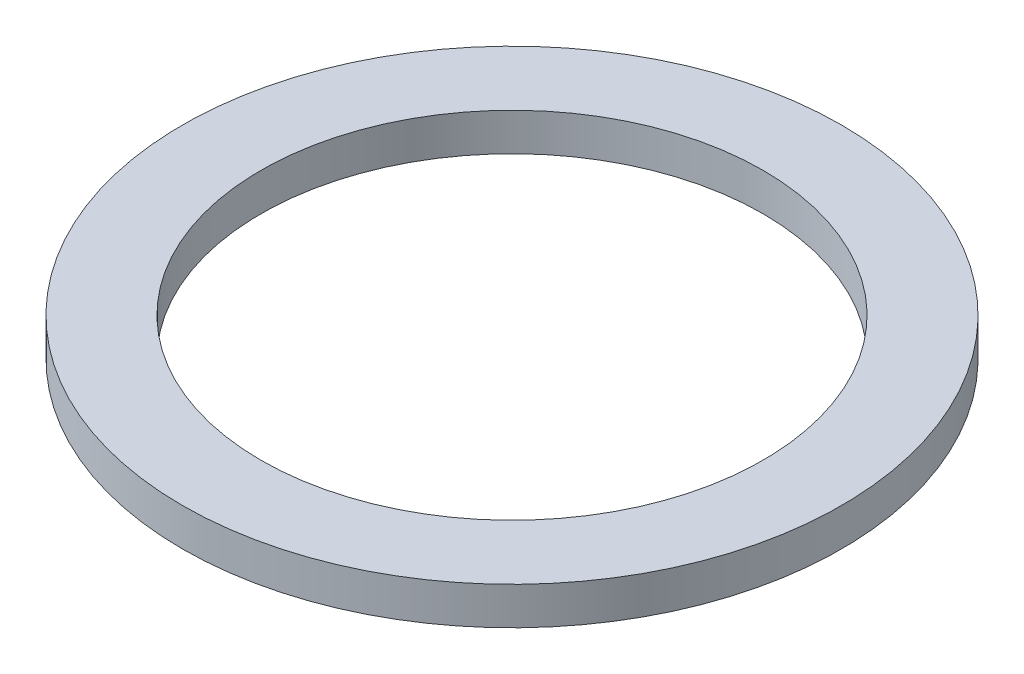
ISO-10303-21;
HEADER;
FILE_DESCRIPTION(('STEP AP214'),'2;1');
FILE_NAME('part.step','',(''),(''),'','','');
FILE_SCHEMA(('AUTOMOTIVE_DESIGN { 1 0 10303 214 1 1 1 1 }'));
ENDSEC;
DATA;
#1=APPLICATION_CONTEXT('core data for automotive mechanical design processes');
#2=APPLICATION_PROTOCOL_DEFINITION('international standard','automotive_design',2000,#1);
#3=PRODUCT_CONTEXT('',#1,'mechanical');
#4=PRODUCT('Part','Part','',(#3));
#5=PRODUCT_RELATED_PRODUCT_CATEGORY('part','',(#4));
#6=PRODUCT_DEFINITION_FORMATION('','',#4);
#7=PRODUCT_DEFINITION_CONTEXT('part definition',#1,'design');
#8=PRODUCT_DEFINITION('design','',#6,#7);
#9=PRODUCT_DEFINITION_SHAPE('','',#8);
#10=(LENGTH_UNIT() NAMED_UNIT(*) SI_UNIT(.MILLI.,.METRE.));
#11=(NAMED_UNIT(*) PLANE_ANGLE_UNIT() SI_UNIT($,.RADIAN.));
#12=(NAMED_UNIT(*) SI_UNIT($,.STERADIAN.) SOLID_ANGLE_UNIT());
#13=UNCERTAINTY_MEASURE_WITH_UNIT(LENGTH_MEASURE(1.E-05),#10,'distance_accuracy_value','');
#14=(GEOMETRIC_REPRESENTATION_CONTEXT(3) GLOBAL_UNCERTAINTY_ASSIGNED_CONTEXT((#13)) GLOBAL_UNIT_ASSIGNED_CONTEXT((#10,
#11,#12)) REPRESENTATION_CONTEXT('',''));
#15=CARTESIAN_POINT('',(0.,0.,0.));
#16=DIRECTION('',(0.,0.,1.));
#17=DIRECTION('',(1.,0.,0.));
#18=AXIS2_PLACEMENT_3D('',#15,#16,#17);
#19=CARTESIAN_POINT('',(0.,6.,0.));
#20=DIRECTION('',(0.,1.,0.));
#21=DIRECTION('',(0.,0.,1.));
#22=AXIS2_PLACEMENT_3D('',#19,#20,#21);
#23=PLANE('',#22);
#24=CARTESIAN_POINT('',(0.,6.,0.));
#25=DIRECTION('',(0.,1.,0.));
#26=DIRECTION('',(0.,0.,1.));
#27=AXIS2_PLACEMENT_3D('',#24,#25,#26);
#28=CIRCLE('',#27,52.5);
#29=CARTESIAN_POINT('',(0.,6.,52.5));
#30=VERTEX_POINT('',#29);
#31=EDGE_CURVE('E10',#30,#30,#28,.T.);
#32=ORIENTED_EDGE('',*,*,#31,.T.);
#33=EDGE_LOOP('',(#32));
#34=FACE_BOUND('',#33,.T.);
#35=CARTESIAN_POINT('',(0.,6.,0.));
#36=DIRECTION('',(0.,1.,0.));
#37=DIRECTION('',(0.,0.,1.));
#38=AXIS2_PLACEMENT_3D('',#35,#36,#37);
#39=CIRCLE('',#38,40.);
#40=CARTESIAN_POINT('',(0.,6.,40.));
#41=VERTEX_POINT('',#40);
#42=EDGE_CURVE('E42',#41,#41,#39,.T.);
#43=ORIENTED_EDGE('',*,*,#42,.F.);
#44=EDGE_LOOP('',(#43));
#45=FACE_BOUND('',#44,.T.);
#46=ADVANCED_FACE('F31',(#34,#45),#23,.T.);
#47=CARTESIAN_POINT('',(0.,0.,0.));
#48=DIRECTION('',(0.,1.,0.));
#49=DIRECTION('',(0.,0.,1.));
#50=AXIS2_PLACEMENT_3D('',#47,#48,#49);
#51=PLANE('',#50);
#52=CARTESIAN_POINT('',(0.,0.,0.));
#53=DIRECTION('',(0.,1.,0.));
#54=DIRECTION('',(0.,0.,1.));
#55=AXIS2_PLACEMENT_3D('',#52,#53,#54);
#56=CIRCLE('',#55,52.5);
#57=CARTESIAN_POINT('',(0.,0.,52.5));
#58=VERTEX_POINT('',#57);
#59=EDGE_CURVE('E35',#58,#58,#56,.T.);
#60=ORIENTED_EDGE('',*,*,#59,.F.);
#61=EDGE_LOOP('',(#60));
#62=FACE_BOUND('',#61,.T.);
#63=CARTESIAN_POINT('',(0.,0.,0.));
#64=DIRECTION('',(0.,1.,0.));
#65=DIRECTION('',(0.,0.,1.));
#66=AXIS2_PLACEMENT_3D('',#63,#64,#65);
#67=CIRCLE('',#66,40.);
#68=CARTESIAN_POINT('',(0.,0.,40.));
#69=VERTEX_POINT('',#68);
#70=EDGE_CURVE('E44',#69,#69,#67,.T.);
#71=ORIENTED_EDGE('',*,*,#70,.T.);
#72=EDGE_LOOP('',(#71));
#73=FACE_BOUND('',#72,.T.);
#74=ADVANCED_FACE('F54',(#62,#73),#51,.F.);
#75=CARTESIAN_POINT('',(0.,6.,0.));
#76=DIRECTION('',(0.,-1.,0.));
#77=DIRECTION('',(0.,0.,-1.));
#78=AXIS2_PLACEMENT_3D('',#75,#76,#77);
#79=CYLINDRICAL_SURFACE('',#78,52.5);
#80=ORIENTED_EDGE('',*,*,#31,.F.);
#81=EDGE_LOOP('',(#80));
#82=FACE_BOUND('',#81,.T.);
#83=ORIENTED_EDGE('',*,*,#59,.T.);
#84=EDGE_LOOP('',(#83));
#85=FACE_BOUND('',#84,.T.);
#86=ADVANCED_FACE('F33',(#82,#85),#79,.T.);
#87=CARTESIAN_POINT('',(0.,6.,0.));
#88=DIRECTION('',(0.,-1.,0.));
#89=DIRECTION('',(0.,0.,-1.));
#90=AXIS2_PLACEMENT_3D('',#87,#88,#89);
#91=CYLINDRICAL_SURFACE('',#90,40.);
#92=ORIENTED_EDGE('',*,*,#42,.T.);
#93=EDGE_LOOP('',(#92));
#94=FACE_BOUND('',#93,.T.);
#95=ORIENTED_EDGE('',*,*,#70,.F.);
#96=EDGE_LOOP('',(#95));
#97=FACE_BOUND('',#96,.T.);
#98=ADVANCED_FACE('F50',(#94,#97),#91,.F.);
#99=CLOSED_SHELL('',(#46,#74,#86,#98));
#100=MANIFOLD_SOLID_BREP('B2',#99);
#101=ADVANCED_BREP_SHAPE_REPRESENTATION('',(#18,#100),#14);
#102=SHAPE_DEFINITION_REPRESENTATION(#9,#101);
ENDSEC;
END-ISO-10303-21;
